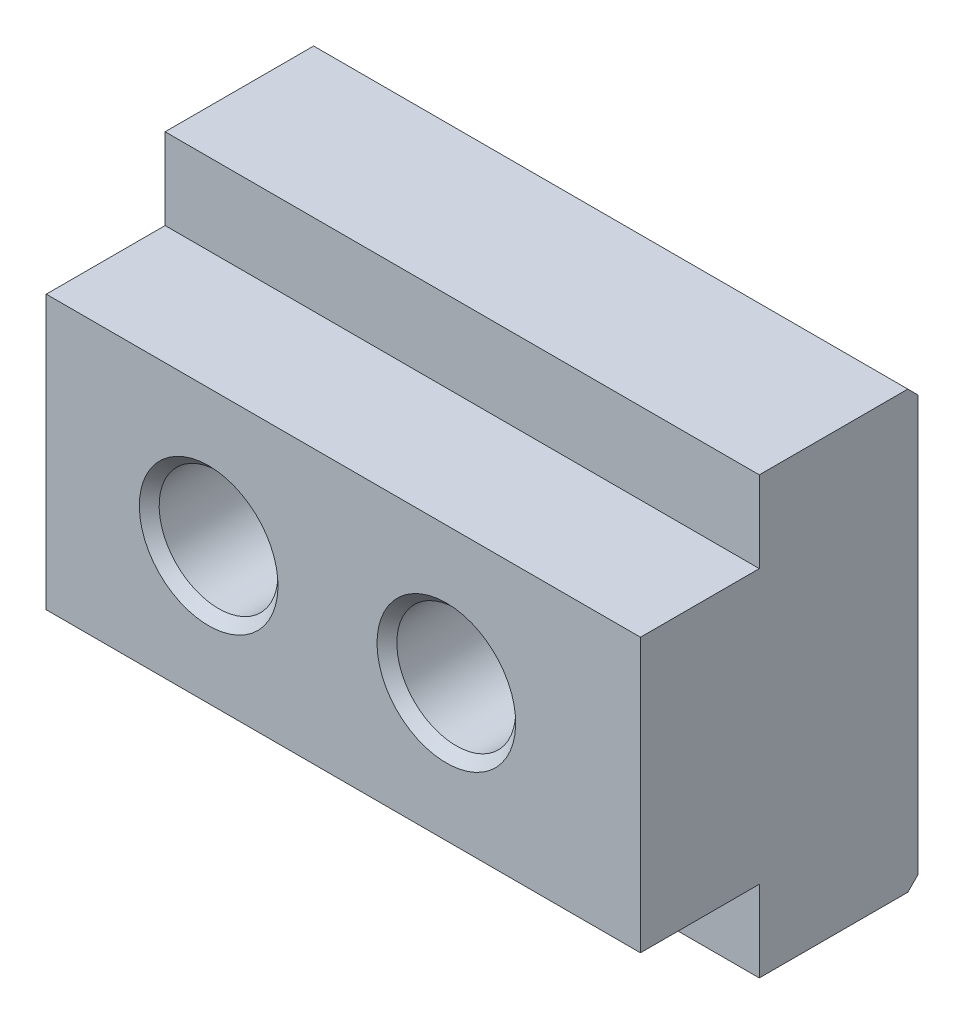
ISO-10303-21;
HEADER;
FILE_DESCRIPTION(('STEP AP214'),'2;1');
FILE_NAME('part.step','',(''),(''),'','','');
FILE_SCHEMA(('AUTOMOTIVE_DESIGN { 1 0 10303 214 1 1 1 1 }'));
ENDSEC;
DATA;
#1=APPLICATION_CONTEXT('core data for automotive mechanical design processes');
#2=APPLICATION_PROTOCOL_DEFINITION('international standard','automotive_design',2000,#1);
#3=PRODUCT_CONTEXT('',#1,'mechanical');
#4=PRODUCT('Part','Part','',(#3));
#5=PRODUCT_RELATED_PRODUCT_CATEGORY('part','',(#4));
#6=PRODUCT_DEFINITION_FORMATION('','',#4);
#7=PRODUCT_DEFINITION_CONTEXT('part definition',#1,'design');
#8=PRODUCT_DEFINITION('design','',#6,#7);
#9=PRODUCT_DEFINITION_SHAPE('','',#8);
#10=(LENGTH_UNIT() NAMED_UNIT(*) SI_UNIT(.MILLI.,.METRE.));
#11=(NAMED_UNIT(*) PLANE_ANGLE_UNIT() SI_UNIT($,.RADIAN.));
#12=(NAMED_UNIT(*) SI_UNIT($,.STERADIAN.) SOLID_ANGLE_UNIT());
#13=UNCERTAINTY_MEASURE_WITH_UNIT(LENGTH_MEASURE(1.E-05),#10,'distance_accuracy_value','');
#14=(GEOMETRIC_REPRESENTATION_CONTEXT(3) GLOBAL_UNCERTAINTY_ASSIGNED_CONTEXT((#13)) GLOBAL_UNIT_ASSIGNED_CONTEXT((#10,
#11,#12)) REPRESENTATION_CONTEXT('',''));
#15=CARTESIAN_POINT('',(0.,0.,0.));
#16=DIRECTION('',(0.,0.,1.));
#17=DIRECTION('',(1.,0.,0.));
#18=AXIS2_PLACEMENT_3D('',#15,#16,#17);
#19=CARTESIAN_POINT('',(21.8,-6.9,0.));
#20=DIRECTION('',(0.,0.,-1.));
#21=DIRECTION('',(0.,1.,0.));
#22=AXIS2_PLACEMENT_3D('',#19,#20,#21);
#23=PLANE('',#22);
#24=DIRECTION('',(1.,0.,0.));
#25=VECTOR('',#24,1.);
#26=CARTESIAN_POINT('',(21.8,-11.,0.));
#27=LINE('',#26,#25);
#28=CARTESIAN_POINT('',(-8.2,-11.,0.));
#29=VERTEX_POINT('',#28);
#30=CARTESIAN_POINT('',(21.8,-11.,0.));
#31=VERTEX_POINT('',#30);
#32=EDGE_CURVE('E94',#29,#31,#27,.T.);
#33=ORIENTED_EDGE('',*,*,#32,.T.);
#34=DIRECTION('',(0.,1.,0.));
#35=VECTOR('',#34,1.);
#36=CARTESIAN_POINT('',(21.8,6.9,0.));
#37=LINE('',#36,#35);
#38=CARTESIAN_POINT('',(21.8,-6.9,0.));
#39=VERTEX_POINT('',#38);
#40=EDGE_CURVE('E180',#31,#39,#37,.T.);
#41=ORIENTED_EDGE('',*,*,#40,.T.);
#42=DIRECTION('',(1.,0.,0.));
#43=VECTOR('',#42,1.);
#44=CARTESIAN_POINT('',(21.8,-6.9,0.));
#45=LINE('',#44,#43);
#46=CARTESIAN_POINT('',(-8.2,-6.9,0.));
#47=VERTEX_POINT('',#46);
#48=EDGE_CURVE('E109',#39,#47,#45,.F.);
#49=ORIENTED_EDGE('',*,*,#48,.T.);
#50=DIRECTION('',(0.,1.,0.));
#51=VECTOR('',#50,1.);
#52=CARTESIAN_POINT('',(-8.2,6.9,0.));
#53=LINE('',#52,#51);
#54=EDGE_CURVE('E88',#29,#47,#53,.T.);
#55=ORIENTED_EDGE('',*,*,#54,.F.);
#56=EDGE_LOOP('',(#33,#41,#49,#55));
#57=FACE_BOUND('',#56,.T.);
#58=ADVANCED_FACE('F14',(#57),#23,.F.);
#59=CARTESIAN_POINT('',(21.8,-6.9,6.));
#60=DIRECTION('',(0.,1.,0.));
#61=DIRECTION('',(0.,0.,1.));
#62=AXIS2_PLACEMENT_3D('',#59,#60,#61);
#63=PLANE('',#62);
#64=ORIENTED_EDGE('',*,*,#48,.F.);
#65=DIRECTION('',(0.,0.,-1.));
#66=VECTOR('',#65,1.);
#67=CARTESIAN_POINT('',(21.8,-6.9,6.));
#68=LINE('',#67,#66);
#69=CARTESIAN_POINT('',(21.8,-6.9,6.));
#70=VERTEX_POINT('',#69);
#71=EDGE_CURVE('E175',#39,#70,#68,.F.);
#72=ORIENTED_EDGE('',*,*,#71,.T.);
#73=DIRECTION('',(1.,0.,0.));
#74=VECTOR('',#73,1.);
#75=CARTESIAN_POINT('',(21.8,-6.9,6.));
#76=LINE('',#75,#74);
#77=CARTESIAN_POINT('',(-8.2,-6.9,6.));
#78=VERTEX_POINT('',#77);
#79=EDGE_CURVE('E127',#70,#78,#76,.F.);
#80=ORIENTED_EDGE('',*,*,#79,.T.);
#81=DIRECTION('',(0.,0.,-1.));
#82=VECTOR('',#81,1.);
#83=CARTESIAN_POINT('',(-8.2,-6.9,6.));
#84=LINE('',#83,#82);
#85=EDGE_CURVE('E111',#47,#78,#84,.F.);
#86=ORIENTED_EDGE('',*,*,#85,.F.);
#87=EDGE_LOOP('',(#64,#72,#80,#86));
#88=FACE_BOUND('',#87,.T.);
#89=ADVANCED_FACE('F163',(#88),#63,.F.);
#90=CARTESIAN_POINT('',(21.8,6.9,6.));
#91=DIRECTION('',(0.,0.,-1.));
#92=DIRECTION('',(0.,1.,0.));
#93=AXIS2_PLACEMENT_3D('',#90,#91,#92);
#94=PLANE('',#93);
#95=CARTESIAN_POINT('',(0.,0.,6.));
#96=DIRECTION('',(0.,0.,-1.));
#97=DIRECTION('',(0.,1.,0.));
#98=AXIS2_PLACEMENT_3D('',#95,#96,#97);
#99=CIRCLE('',#98,3.5);
#100=CARTESIAN_POINT('',(0.,3.5,6.));
#101=VERTEX_POINT('',#100);
#102=EDGE_CURVE('E147',#101,#101,#99,.T.);
#103=ORIENTED_EDGE('',*,*,#102,.T.);
#104=EDGE_LOOP('',(#103));
#105=FACE_BOUND('',#104,.T.);
#106=CARTESIAN_POINT('',(12.,0.,6.));
#107=DIRECTION('',(0.,0.,-1.));
#108=DIRECTION('',(0.,1.,0.));
#109=AXIS2_PLACEMENT_3D('',#106,#107,#108);
#110=CIRCLE('',#109,3.5);
#111=CARTESIAN_POINT('',(12.,3.5,6.));
#112=VERTEX_POINT('',#111);
#113=EDGE_CURVE('E144',#112,#112,#110,.T.);
#114=ORIENTED_EDGE('',*,*,#113,.T.);
#115=EDGE_LOOP('',(#114));
#116=FACE_BOUND('',#115,.T.);
#117=ORIENTED_EDGE('',*,*,#79,.F.);
#118=DIRECTION('',(0.,1.,0.));
#119=VECTOR('',#118,1.);
#120=CARTESIAN_POINT('',(21.8,6.9,6.));
#121=LINE('',#120,#119);
#122=CARTESIAN_POINT('',(21.8,6.9,6.));
#123=VERTEX_POINT('',#122);
#124=EDGE_CURVE('E169',#70,#123,#121,.T.);
#125=ORIENTED_EDGE('',*,*,#124,.T.);
#126=DIRECTION('',(-1.,0.,0.));
#127=VECTOR('',#126,1.);
#128=CARTESIAN_POINT('',(21.8,6.9,6.));
#129=LINE('',#128,#127);
#130=CARTESIAN_POINT('',(-8.2,6.9,6.));
#131=VERTEX_POINT('',#130);
#132=EDGE_CURVE('E124',#123,#131,#129,.T.);
#133=ORIENTED_EDGE('',*,*,#132,.T.);
#134=DIRECTION('',(0.,1.,0.));
#135=VECTOR('',#134,1.);
#136=CARTESIAN_POINT('',(-8.2,6.9,6.));
#137=LINE('',#136,#135);
#138=EDGE_CURVE('E113',#78,#131,#137,.T.);
#139=ORIENTED_EDGE('',*,*,#138,.F.);
#140=EDGE_LOOP('',(#117,#125,#133,#139));
#141=FACE_BOUND('',#140,.T.);
#142=ADVANCED_FACE('F159',(#105,#116,#141),#94,.F.);
#143=CARTESIAN_POINT('',(21.8,6.9,6.));
#144=DIRECTION('',(0.,-1.,0.));
#145=DIRECTION('',(-1.,0.,0.));
#146=AXIS2_PLACEMENT_3D('',#143,#144,#145);
#147=PLANE('',#146);
#148=ORIENTED_EDGE('',*,*,#132,.F.);
#149=DIRECTION('',(0.,0.,-1.));
#150=VECTOR('',#149,1.);
#151=CARTESIAN_POINT('',(21.8,6.9,6.));
#152=LINE('',#151,#150);
#153=CARTESIAN_POINT('',(21.8,6.9,0.));
#154=VERTEX_POINT('',#153);
#155=EDGE_CURVE('E178',#123,#154,#152,.T.);
#156=ORIENTED_EDGE('',*,*,#155,.T.);
#157=DIRECTION('',(1.,0.,0.));
#158=VECTOR('',#157,1.);
#159=CARTESIAN_POINT('',(21.8,6.9,0.));
#160=LINE('',#159,#158);
#161=CARTESIAN_POINT('',(-8.2,6.9,0.));
#162=VERTEX_POINT('',#161);
#163=EDGE_CURVE('E121',#154,#162,#160,.F.);
#164=ORIENTED_EDGE('',*,*,#163,.T.);
#165=DIRECTION('',(0.,0.,-1.));
#166=VECTOR('',#165,1.);
#167=CARTESIAN_POINT('',(-8.2,6.9,6.));
#168=LINE('',#167,#166);
#169=EDGE_CURVE('E194',#131,#162,#168,.T.);
#170=ORIENTED_EDGE('',*,*,#169,.F.);
#171=EDGE_LOOP('',(#148,#156,#164,#170));
#172=FACE_BOUND('',#171,.T.);
#173=ADVANCED_FACE('F162',(#172),#147,.F.);
#174=CARTESIAN_POINT('',(21.8,11.,0.));
#175=DIRECTION('',(0.,0.,-1.));
#176=DIRECTION('',(1.,0.,0.));
#177=AXIS2_PLACEMENT_3D('',#174,#175,#176);
#178=PLANE('',#177);
#179=ORIENTED_EDGE('',*,*,#163,.F.);
#180=DIRECTION('',(0.,1.,0.));
#181=VECTOR('',#180,1.);
#182=CARTESIAN_POINT('',(21.8,6.9,0.));
#183=LINE('',#182,#181);
#184=CARTESIAN_POINT('',(21.8,11.,0.));
#185=VERTEX_POINT('',#184);
#186=EDGE_CURVE('E227',#154,#185,#183,.T.);
#187=ORIENTED_EDGE('',*,*,#186,.T.);
#188=DIRECTION('',(-1.,0.,0.));
#189=VECTOR('',#188,1.);
#190=CARTESIAN_POINT('',(21.8,11.,0.));
#191=LINE('',#190,#189);
#192=CARTESIAN_POINT('',(-8.2,11.,0.));
#193=VERTEX_POINT('',#192);
#194=EDGE_CURVE('E102',#185,#193,#191,.T.);
#195=ORIENTED_EDGE('',*,*,#194,.T.);
#196=DIRECTION('',(0.,1.,0.));
#197=VECTOR('',#196,1.);
#198=CARTESIAN_POINT('',(-8.2,6.9,0.));
#199=LINE('',#198,#197);
#200=EDGE_CURVE('E192',#162,#193,#199,.T.);
#201=ORIENTED_EDGE('',*,*,#200,.F.);
#202=EDGE_LOOP('',(#179,#187,#195,#201));
#203=FACE_BOUND('',#202,.T.);
#204=ADVANCED_FACE('F200',(#203),#178,.F.);
#205=CARTESIAN_POINT('',(21.8,11.,0.));
#206=DIRECTION('',(0.,-1.,0.));
#207=DIRECTION('',(-1.,0.,0.));
#208=AXIS2_PLACEMENT_3D('',#205,#206,#207);
#209=PLANE('',#208);
#210=DIRECTION('',(1.,0.,0.));
#211=VECTOR('',#210,1.);
#212=CARTESIAN_POINT('',(21.8,11.,-7.5));
#213=LINE('',#212,#211);
#214=CARTESIAN_POINT('',(21.8,11.,-7.5));
#215=VERTEX_POINT('',#214);
#216=CARTESIAN_POINT('',(-8.2,11.,-7.5));
#217=VERTEX_POINT('',#216);
#218=EDGE_CURVE('E101',#215,#217,#213,.F.);
#219=ORIENTED_EDGE('',*,*,#218,.T.);
#220=DIRECTION('',(0.,0.,-1.));
#221=VECTOR('',#220,1.);
#222=CARTESIAN_POINT('',(-8.2,11.,6.));
#223=LINE('',#222,#221);
#224=EDGE_CURVE('E190',#193,#217,#223,.T.);
#225=ORIENTED_EDGE('',*,*,#224,.F.);
#226=ORIENTED_EDGE('',*,*,#194,.F.);
#227=DIRECTION('',(0.,0.,-1.));
#228=VECTOR('',#227,1.);
#229=CARTESIAN_POINT('',(21.8,11.,6.));
#230=LINE('',#229,#228);
#231=EDGE_CURVE('E208',#185,#215,#230,.T.);
#232=ORIENTED_EDGE('',*,*,#231,.T.);
#233=EDGE_LOOP('',(#219,#225,#226,#232));
#234=FACE_BOUND('',#233,.T.);
#235=ADVANCED_FACE('F206',(#234),#209,.F.);
#236=CARTESIAN_POINT('',(21.8,-11.,0.));
#237=DIRECTION('',(0.,1.,0.));
#238=DIRECTION('',(1.,0.,0.));
#239=AXIS2_PLACEMENT_3D('',#236,#237,#238);
#240=PLANE('',#239);
#241=DIRECTION('',(1.,0.,0.));
#242=VECTOR('',#241,1.);
#243=CARTESIAN_POINT('',(21.8,-11.,-7.5));
#244=LINE('',#243,#242);
#245=CARTESIAN_POINT('',(-8.2,-11.,-7.5));
#246=VERTEX_POINT('',#245);
#247=CARTESIAN_POINT('',(21.8,-11.,-7.5));
#248=VERTEX_POINT('',#247);
#249=EDGE_CURVE('E182',#246,#248,#244,.T.);
#250=ORIENTED_EDGE('',*,*,#249,.T.);
#251=DIRECTION('',(0.,0.,-1.));
#252=VECTOR('',#251,1.);
#253=CARTESIAN_POINT('',(21.8,-11.,6.));
#254=LINE('',#253,#252);
#255=EDGE_CURVE('E98',#248,#31,#254,.F.);
#256=ORIENTED_EDGE('',*,*,#255,.T.);
#257=ORIENTED_EDGE('',*,*,#32,.F.);
#258=DIRECTION('',(0.,0.,-1.));
#259=VECTOR('',#258,1.);
#260=CARTESIAN_POINT('',(-8.2,-11.,6.));
#261=LINE('',#260,#259);
#262=EDGE_CURVE('E96',#246,#29,#261,.F.);
#263=ORIENTED_EDGE('',*,*,#262,.F.);
#264=EDGE_LOOP('',(#250,#256,#257,#263));
#265=FACE_BOUND('',#264,.T.);
#266=ADVANCED_FACE('F95',(#265),#240,.F.);
#267=CARTESIAN_POINT('',(21.8,11.,-7.5));
#268=DIRECTION('',(0.,-0.707106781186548,0.707106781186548));
#269=DIRECTION('',(0.,-0.707106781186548,-0.707106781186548));
#270=AXIS2_PLACEMENT_3D('',#267,#268,#269);
#271=PLANE('',#270);
#272=DIRECTION('',(1.,0.,0.));
#273=VECTOR('',#272,1.);
#274=CARTESIAN_POINT('',(21.8,10.5,-8.));
#275=LINE('',#274,#273);
#276=CARTESIAN_POINT('',(21.8,10.5,-8.));
#277=VERTEX_POINT('',#276);
#278=CARTESIAN_POINT('',(-8.2,10.5,-8.));
#279=VERTEX_POINT('',#278);
#280=EDGE_CURVE('E214',#277,#279,#275,.F.);
#281=ORIENTED_EDGE('',*,*,#280,.T.);
#282=DIRECTION('',(0.,-0.707106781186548,-0.707106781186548));
#283=VECTOR('',#282,1.);
#284=CARTESIAN_POINT('',(-8.2,11.,-7.5));
#285=LINE('',#284,#283);
#286=EDGE_CURVE('E188',#217,#279,#285,.T.);
#287=ORIENTED_EDGE('',*,*,#286,.F.);
#288=ORIENTED_EDGE('',*,*,#218,.F.);
#289=DIRECTION('',(0.,-0.707106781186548,-0.707106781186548));
#290=VECTOR('',#289,1.);
#291=CARTESIAN_POINT('',(21.8,11.,-7.5));
#292=LINE('',#291,#290);
#293=EDGE_CURVE('E215',#215,#277,#292,.T.);
#294=ORIENTED_EDGE('',*,*,#293,.T.);
#295=EDGE_LOOP('',(#281,#287,#288,#294));
#296=FACE_BOUND('',#295,.T.);
#297=ADVANCED_FACE('F213',(#296),#271,.F.);
#298=CARTESIAN_POINT('',(-8.2,6.9,6.));
#299=DIRECTION('',(-1.,0.,0.));
#300=DIRECTION('',(0.,1.,0.));
#301=AXIS2_PLACEMENT_3D('',#298,#299,#300);
#302=PLANE('',#301);
#303=ORIENTED_EDGE('',*,*,#224,.T.);
#304=ORIENTED_EDGE('',*,*,#286,.T.);
#305=DIRECTION('',(0.,-1.,0.));
#306=VECTOR('',#305,1.);
#307=CARTESIAN_POINT('',(-8.2,11.,-8.));
#308=LINE('',#307,#306);
#309=CARTESIAN_POINT('',(-8.2,-10.5,-8.));
#310=VERTEX_POINT('',#309);
#311=EDGE_CURVE('E217',#279,#310,#308,.T.);
#312=ORIENTED_EDGE('',*,*,#311,.T.);
#313=DIRECTION('',(0.,-0.707106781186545,0.70710678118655));
#314=VECTOR('',#313,1.);
#315=CARTESIAN_POINT('',(-8.2,-10.5,-8.));
#316=LINE('',#315,#314);
#317=EDGE_CURVE('E107',#310,#246,#316,.T.);
#318=ORIENTED_EDGE('',*,*,#317,.T.);
#319=ORIENTED_EDGE('',*,*,#262,.T.);
#320=ORIENTED_EDGE('',*,*,#54,.T.);
#321=ORIENTED_EDGE('',*,*,#85,.T.);
#322=ORIENTED_EDGE('',*,*,#138,.T.);
#323=ORIENTED_EDGE('',*,*,#169,.T.);
#324=ORIENTED_EDGE('',*,*,#200,.T.);
#325=EDGE_LOOP('',(#303,#304,#312,#318,#319,#320,#321,#322,#323,#324));
#326=FACE_BOUND('',#325,.T.);
#327=ADVANCED_FACE('F105',(#326),#302,.T.);
#328=CARTESIAN_POINT('',(21.8,-10.5,-8.));
#329=DIRECTION('',(0.,0.70710678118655,0.707106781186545));
#330=DIRECTION('',(0.,-0.707106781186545,0.70710678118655));
#331=AXIS2_PLACEMENT_3D('',#328,#329,#330);
#332=PLANE('',#331);
#333=ORIENTED_EDGE('',*,*,#249,.F.);
#334=ORIENTED_EDGE('',*,*,#317,.F.);
#335=DIRECTION('',(1.,0.,0.));
#336=VECTOR('',#335,1.);
#337=CARTESIAN_POINT('',(21.8,-10.5,-8.));
#338=LINE('',#337,#336);
#339=CARTESIAN_POINT('',(21.8,-10.5,-8.));
#340=VERTEX_POINT('',#339);
#341=EDGE_CURVE('E219',#310,#340,#338,.T.);
#342=ORIENTED_EDGE('',*,*,#341,.T.);
#343=DIRECTION('',(0.,-0.707106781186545,0.70710678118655));
#344=VECTOR('',#343,1.);
#345=CARTESIAN_POINT('',(21.8,-10.5,-8.));
#346=LINE('',#345,#344);
#347=EDGE_CURVE('E31',#340,#248,#346,.T.);
#348=ORIENTED_EDGE('',*,*,#347,.T.);
#349=EDGE_LOOP('',(#333,#334,#342,#348));
#350=FACE_BOUND('',#349,.T.);
#351=ADVANCED_FACE('F232',(#350),#332,.F.);
#352=CARTESIAN_POINT('',(21.8,6.9,6.));
#353=DIRECTION('',(-1.,0.,0.));
#354=DIRECTION('',(0.,1.,0.));
#355=AXIS2_PLACEMENT_3D('',#352,#353,#354);
#356=PLANE('',#355);
#357=ORIENTED_EDGE('',*,*,#347,.F.);
#358=DIRECTION('',(0.,-1.,0.));
#359=VECTOR('',#358,1.);
#360=CARTESIAN_POINT('',(21.8,11.,-8.));
#361=LINE('',#360,#359);
#362=EDGE_CURVE('E135',#340,#277,#361,.F.);
#363=ORIENTED_EDGE('',*,*,#362,.T.);
#364=ORIENTED_EDGE('',*,*,#293,.F.);
#365=ORIENTED_EDGE('',*,*,#231,.F.);
#366=ORIENTED_EDGE('',*,*,#186,.F.);
#367=ORIENTED_EDGE('',*,*,#155,.F.);
#368=ORIENTED_EDGE('',*,*,#124,.F.);
#369=ORIENTED_EDGE('',*,*,#71,.F.);
#370=ORIENTED_EDGE('',*,*,#40,.F.);
#371=ORIENTED_EDGE('',*,*,#255,.F.);
#372=EDGE_LOOP('',(#357,#363,#364,#365,#366,#367,#368,#369,#370,#371));
#373=FACE_BOUND('',#372,.T.);
#374=ADVANCED_FACE('F174',(#373),#356,.F.);
#375=CARTESIAN_POINT('',(21.8,11.,-8.));
#376=DIRECTION('',(0.,0.,1.));
#377=DIRECTION('',(0.,-1.,0.));
#378=AXIS2_PLACEMENT_3D('',#375,#376,#377);
#379=PLANE('',#378);
#380=CARTESIAN_POINT('',(0.,0.,-8.));
#381=DIRECTION('',(0.,0.,1.));
#382=DIRECTION('',(0.,-1.,0.));
#383=AXIS2_PLACEMENT_3D('',#380,#381,#382);
#384=CIRCLE('',#383,3.5);
#385=CARTESIAN_POINT('',(0.,-3.5,-8.));
#386=VERTEX_POINT('',#385);
#387=EDGE_CURVE('E141',#386,#386,#384,.T.);
#388=ORIENTED_EDGE('',*,*,#387,.T.);
#389=EDGE_LOOP('',(#388));
#390=FACE_BOUND('',#389,.T.);
#391=CARTESIAN_POINT('',(12.,0.,-8.));
#392=DIRECTION('',(0.,0.,1.));
#393=DIRECTION('',(0.,-1.,0.));
#394=AXIS2_PLACEMENT_3D('',#391,#392,#393);
#395=CIRCLE('',#394,3.5);
#396=CARTESIAN_POINT('',(12.,-3.5,-8.));
#397=VERTEX_POINT('',#396);
#398=EDGE_CURVE('E138',#397,#397,#395,.T.);
#399=ORIENTED_EDGE('',*,*,#398,.T.);
#400=EDGE_LOOP('',(#399));
#401=FACE_BOUND('',#400,.T.);
#402=ORIENTED_EDGE('',*,*,#341,.F.);
#403=ORIENTED_EDGE('',*,*,#311,.F.);
#404=ORIENTED_EDGE('',*,*,#280,.F.);
#405=ORIENTED_EDGE('',*,*,#362,.F.);
#406=EDGE_LOOP('',(#402,#403,#404,#405));
#407=FACE_BOUND('',#406,.T.);
#408=ADVANCED_FACE('F233',(#390,#401,#407),#379,.F.);
#409=CARTESIAN_POINT('',(0.,0.,6.));
#410=DIRECTION('',(0.,0.,-1.));
#411=DIRECTION('',(0.,1.,0.));
#412=AXIS2_PLACEMENT_3D('',#409,#410,#411);
#413=CYLINDRICAL_SURFACE('',#412,3.);
#414=CARTESIAN_POINT('',(0.,0.,-7.5));
#415=DIRECTION('',(0.,0.,1.));
#416=DIRECTION('',(0.,-1.,0.));
#417=AXIS2_PLACEMENT_3D('',#414,#415,#416);
#418=CIRCLE('',#417,3.);
#419=CARTESIAN_POINT('',(0.,-3.,-7.50000000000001));
#420=VERTEX_POINT('',#419);
#421=EDGE_CURVE('E134',#420,#420,#418,.F.);
#422=ORIENTED_EDGE('',*,*,#421,.T.);
#423=EDGE_LOOP('',(#422));
#424=FACE_BOUND('',#423,.T.);
#425=CARTESIAN_POINT('',(0.,0.,5.5));
#426=DIRECTION('',(0.,0.,-1.));
#427=DIRECTION('',(1.,0.,0.));
#428=AXIS2_PLACEMENT_3D('',#425,#426,#427);
#429=CIRCLE('',#428,3.);
#430=CARTESIAN_POINT('',(3.,0.,5.5));
#431=VERTEX_POINT('',#430);
#432=EDGE_CURVE('E131',#431,#431,#429,.F.);
#433=ORIENTED_EDGE('',*,*,#432,.T.);
#434=EDGE_LOOP('',(#433));
#435=FACE_BOUND('',#434,.T.);
#436=ADVANCED_FACE('F235',(#424,#435),#413,.F.);
#437=CARTESIAN_POINT('',(12.,0.,6.));
#438=DIRECTION('',(0.,0.,-1.));
#439=DIRECTION('',(0.,1.,0.));
#440=AXIS2_PLACEMENT_3D('',#437,#438,#439);
#441=CYLINDRICAL_SURFACE('',#440,3.);
#442=CARTESIAN_POINT('',(12.,0.,-7.5));
#443=DIRECTION('',(0.,0.,1.));
#444=DIRECTION('',(0.,-1.,0.));
#445=AXIS2_PLACEMENT_3D('',#442,#443,#444);
#446=CIRCLE('',#445,3.);
#447=CARTESIAN_POINT('',(12.,-3.,-7.50000000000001));
#448=VERTEX_POINT('',#447);
#449=EDGE_CURVE('E9',#448,#448,#446,.F.);
#450=ORIENTED_EDGE('',*,*,#449,.T.);
#451=EDGE_LOOP('',(#450));
#452=FACE_BOUND('',#451,.T.);
#453=CARTESIAN_POINT('',(12.,0.,5.5));
#454=DIRECTION('',(0.,0.,-1.));
#455=DIRECTION('',(1.,0.,0.));
#456=AXIS2_PLACEMENT_3D('',#453,#454,#455);
#457=CIRCLE('',#456,3.);
#458=CARTESIAN_POINT('',(15.,0.,5.5));
#459=VERTEX_POINT('',#458);
#460=EDGE_CURVE('E23',#459,#459,#457,.F.);
#461=ORIENTED_EDGE('',*,*,#460,.T.);
#462=EDGE_LOOP('',(#461));
#463=FACE_BOUND('',#462,.T.);
#464=ADVANCED_FACE('F152',(#452,#463),#441,.F.);
#465=CARTESIAN_POINT('',(0.,0.,-7.5));
#466=DIRECTION('',(0.,0.,-1.));
#467=DIRECTION('',(0.,1.,0.));
#468=AXIS2_PLACEMENT_3D('',#465,#466,#467);
#469=CONICAL_SURFACE('',#468,3.,0.785398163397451);
#470=ORIENTED_EDGE('',*,*,#387,.F.);
#471=EDGE_LOOP('',(#470));
#472=FACE_BOUND('',#471,.T.);
#473=ORIENTED_EDGE('',*,*,#421,.F.);
#474=EDGE_LOOP('',(#473));
#475=FACE_BOUND('',#474,.T.);
#476=ADVANCED_FACE('F268',(#472,#475),#469,.F.);
#477=CARTESIAN_POINT('',(0.,0.,6.));
#478=DIRECTION('',(0.,0.,1.));
#479=DIRECTION('',(-1.,0.,0.));
#480=AXIS2_PLACEMENT_3D('',#477,#478,#479);
#481=CONICAL_SURFACE('',#480,3.5,0.785398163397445);
#482=ORIENTED_EDGE('',*,*,#432,.F.);
#483=EDGE_LOOP('',(#482));
#484=FACE_BOUND('',#483,.T.);
#485=ORIENTED_EDGE('',*,*,#102,.F.);
#486=EDGE_LOOP('',(#485));
#487=FACE_BOUND('',#486,.T.);
#488=ADVANCED_FACE('F271',(#484,#487),#481,.F.);
#489=CARTESIAN_POINT('',(12.,0.,-7.5));
#490=DIRECTION('',(0.,0.,-1.));
#491=DIRECTION('',(0.,1.,0.));
#492=AXIS2_PLACEMENT_3D('',#489,#490,#491);
#493=CONICAL_SURFACE('',#492,3.,0.785398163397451);
#494=ORIENTED_EDGE('',*,*,#398,.F.);
#495=EDGE_LOOP('',(#494));
#496=FACE_BOUND('',#495,.T.);
#497=ORIENTED_EDGE('',*,*,#449,.F.);
#498=EDGE_LOOP('',(#497));
#499=FACE_BOUND('',#498,.T.);
#500=ADVANCED_FACE('F156',(#496,#499),#493,.F.);
#501=CARTESIAN_POINT('',(12.,0.,6.));
#502=DIRECTION('',(0.,0.,1.));
#503=DIRECTION('',(-1.,0.,0.));
#504=AXIS2_PLACEMENT_3D('',#501,#502,#503);
#505=CONICAL_SURFACE('',#504,3.5,0.785398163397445);
#506=ORIENTED_EDGE('',*,*,#460,.F.);
#507=EDGE_LOOP('',(#506));
#508=FACE_BOUND('',#507,.T.);
#509=ORIENTED_EDGE('',*,*,#113,.F.);
#510=EDGE_LOOP('',(#509));
#511=FACE_BOUND('',#510,.T.);
#512=ADVANCED_FACE('F16',(#508,#511),#505,.F.);
#513=CLOSED_SHELL('',(#58,#89,#142,#173,#204,#235,#266,#297,#327,#351,#374,#408,#436,#464,#476,
#488,#500,#512));
#514=MANIFOLD_SOLID_BREP('B1',#513);
#515=ADVANCED_BREP_SHAPE_REPRESENTATION('',(#18,#514),#14);
#516=SHAPE_DEFINITION_REPRESENTATION(#9,#515);
ENDSEC;
END-ISO-10303-21;
